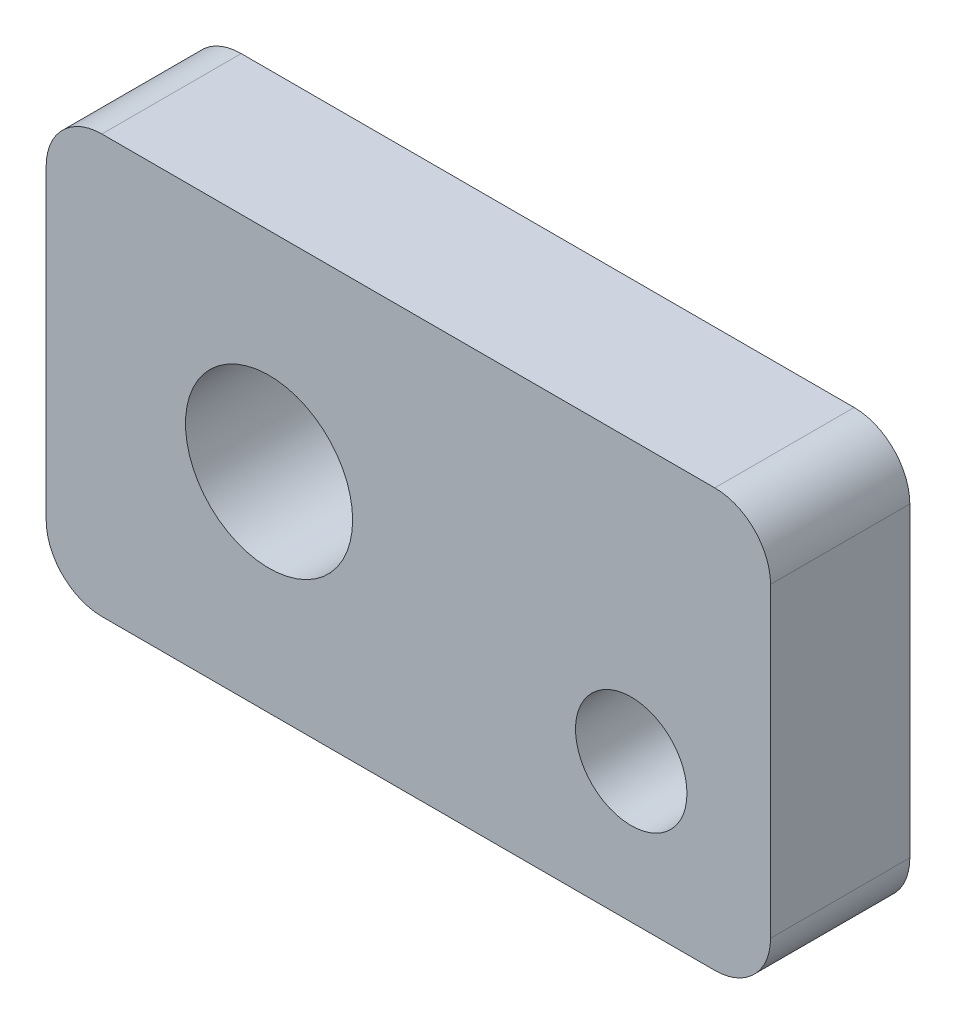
ISO-10303-21;
HEADER;
FILE_DESCRIPTION(('STEP AP214'),'2;1');
FILE_NAME('part.step','',(''),(''),'','','');
FILE_SCHEMA(('AUTOMOTIVE_DESIGN { 1 0 10303 214 1 1 1 1 }'));
ENDSEC;
DATA;
#1=APPLICATION_CONTEXT('core data for automotive mechanical design processes');
#2=APPLICATION_PROTOCOL_DEFINITION('international standard','automotive_design',2000,#1);
#3=PRODUCT_CONTEXT('',#1,'mechanical');
#4=PRODUCT('Part','Part','',(#3));
#5=PRODUCT_RELATED_PRODUCT_CATEGORY('part','',(#4));
#6=PRODUCT_DEFINITION_FORMATION('','',#4);
#7=PRODUCT_DEFINITION_CONTEXT('part definition',#1,'design');
#8=PRODUCT_DEFINITION('design','',#6,#7);
#9=PRODUCT_DEFINITION_SHAPE('','',#8);
#10=(LENGTH_UNIT() NAMED_UNIT(*) SI_UNIT(.MILLI.,.METRE.));
#11=(NAMED_UNIT(*) PLANE_ANGLE_UNIT() SI_UNIT($,.RADIAN.));
#12=(NAMED_UNIT(*) SI_UNIT($,.STERADIAN.) SOLID_ANGLE_UNIT());
#13=UNCERTAINTY_MEASURE_WITH_UNIT(LENGTH_MEASURE(1.E-05),#10,'distance_accuracy_value','');
#14=(GEOMETRIC_REPRESENTATION_CONTEXT(3) GLOBAL_UNCERTAINTY_ASSIGNED_CONTEXT((#13)) GLOBAL_UNIT_ASSIGNED_CONTEXT((#10,
#11,#12)) REPRESENTATION_CONTEXT('',''));
#15=CARTESIAN_POINT('',(0.,0.,0.));
#16=DIRECTION('',(0.,0.,1.));
#17=DIRECTION('',(1.,0.,0.));
#18=AXIS2_PLACEMENT_3D('',#15,#16,#17);
#19=CARTESIAN_POINT('',(0.,0.,5.));
#20=DIRECTION('',(0.,0.,1.));
#21=DIRECTION('',(1.,0.,0.));
#22=AXIS2_PLACEMENT_3D('',#19,#20,#21);
#23=PLANE('',#22);
#24=CARTESIAN_POINT('',(-5.,0.,5.));
#25=DIRECTION('',(0.,0.,1.));
#26=DIRECTION('',(1.,0.,0.));
#27=AXIS2_PLACEMENT_3D('',#24,#25,#26);
#28=CIRCLE('',#27,3.);
#29=CARTESIAN_POINT('',(-2.,0.,5.));
#30=VERTEX_POINT('',#29);
#31=EDGE_CURVE('E165',#30,#30,#28,.T.);
#32=ORIENTED_EDGE('',*,*,#31,.F.);
#33=EDGE_LOOP('',(#32));
#34=FACE_BOUND('',#33,.T.);
#35=DIRECTION('',(0.,-1.,0.));
#36=VECTOR('',#35,1.);
#37=CARTESIAN_POINT('',(-13.,7.50000000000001,5.));
#38=LINE('',#37,#36);
#39=CARTESIAN_POINT('',(-13.,5.50000000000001,5.));
#40=VERTEX_POINT('',#39);
#41=CARTESIAN_POINT('',(-13.,-5.49999999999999,5.));
#42=VERTEX_POINT('',#41);
#43=EDGE_CURVE('E172',#40,#42,#38,.T.);
#44=ORIENTED_EDGE('',*,*,#43,.T.);
#45=CARTESIAN_POINT('',(-11.,-5.49999999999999,5.));
#46=DIRECTION('',(0.,0.,1.));
#47=DIRECTION('',(1.,0.,0.));
#48=AXIS2_PLACEMENT_3D('',#45,#46,#47);
#49=CIRCLE('',#48,2.);
#50=CARTESIAN_POINT('',(-11.,-7.49999999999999,5.));
#51=VERTEX_POINT('',#50);
#52=EDGE_CURVE('E149',#42,#51,#49,.T.);
#53=ORIENTED_EDGE('',*,*,#52,.T.);
#54=DIRECTION('',(1.,0.,0.));
#55=VECTOR('',#54,1.);
#56=CARTESIAN_POINT('',(-13.,-7.49999999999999,5.));
#57=LINE('',#56,#55);
#58=CARTESIAN_POINT('',(11.,-7.49999999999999,5.));
#59=VERTEX_POINT('',#58);
#60=EDGE_CURVE('E120',#51,#59,#57,.T.);
#61=ORIENTED_EDGE('',*,*,#60,.T.);
#62=CARTESIAN_POINT('',(11.,-5.49999999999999,5.));
#63=DIRECTION('',(0.,0.,1.));
#64=DIRECTION('',(1.,0.,0.));
#65=AXIS2_PLACEMENT_3D('',#62,#63,#64);
#66=CIRCLE('',#65,2.);
#67=CARTESIAN_POINT('',(13.,-5.49999999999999,5.));
#68=VERTEX_POINT('',#67);
#69=EDGE_CURVE('E147',#59,#68,#66,.T.);
#70=ORIENTED_EDGE('',*,*,#69,.T.);
#71=DIRECTION('',(0.,1.,0.));
#72=VECTOR('',#71,1.);
#73=CARTESIAN_POINT('',(13.,7.50000000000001,5.));
#74=LINE('',#73,#72);
#75=CARTESIAN_POINT('',(13.,5.50000000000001,5.));
#76=VERTEX_POINT('',#75);
#77=EDGE_CURVE('E127',#68,#76,#74,.T.);
#78=ORIENTED_EDGE('',*,*,#77,.T.);
#79=CARTESIAN_POINT('',(11.,5.50000000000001,5.));
#80=DIRECTION('',(0.,0.,1.));
#81=DIRECTION('',(1.,0.,0.));
#82=AXIS2_PLACEMENT_3D('',#79,#80,#81);
#83=CIRCLE('',#82,2.);
#84=CARTESIAN_POINT('',(11.,7.50000000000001,5.));
#85=VERTEX_POINT('',#84);
#86=EDGE_CURVE('E55',#76,#85,#83,.T.);
#87=ORIENTED_EDGE('',*,*,#86,.T.);
#88=DIRECTION('',(-1.,0.,0.));
#89=VECTOR('',#88,1.);
#90=CARTESIAN_POINT('',(-13.,7.50000000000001,5.));
#91=LINE('',#90,#89);
#92=CARTESIAN_POINT('',(-11.,7.50000000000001,5.));
#93=VERTEX_POINT('',#92);
#94=EDGE_CURVE('E130',#85,#93,#91,.T.);
#95=ORIENTED_EDGE('',*,*,#94,.T.);
#96=CARTESIAN_POINT('',(-11.,5.50000000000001,5.));
#97=DIRECTION('',(0.,0.,1.));
#98=DIRECTION('',(1.,0.,0.));
#99=AXIS2_PLACEMENT_3D('',#96,#97,#98);
#100=CIRCLE('',#99,2.);
#101=EDGE_CURVE('E144',#93,#40,#100,.T.);
#102=ORIENTED_EDGE('',*,*,#101,.T.);
#103=EDGE_LOOP('',(#44,#53,#61,#70,#78,#87,#95,#102));
#104=FACE_BOUND('',#103,.T.);
#105=CARTESIAN_POINT('',(8.,-2.49999999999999,5.));
#106=DIRECTION('',(0.,0.,1.));
#107=DIRECTION('',(1.,0.,0.));
#108=AXIS2_PLACEMENT_3D('',#105,#106,#107);
#109=CIRCLE('',#108,2.);
#110=CARTESIAN_POINT('',(10.,-2.49999999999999,5.));
#111=VERTEX_POINT('',#110);
#112=EDGE_CURVE('E177',#111,#111,#109,.T.);
#113=ORIENTED_EDGE('',*,*,#112,.F.);
#114=EDGE_LOOP('',(#113));
#115=FACE_BOUND('',#114,.T.);
#116=ADVANCED_FACE('F34',(#34,#104,#115),#23,.T.);
#117=CARTESIAN_POINT('',(0.,0.,0.));
#118=DIRECTION('',(0.,0.,1.));
#119=DIRECTION('',(1.,0.,0.));
#120=AXIS2_PLACEMENT_3D('',#117,#118,#119);
#121=PLANE('',#120);
#122=DIRECTION('',(1.,0.,0.));
#123=VECTOR('',#122,1.);
#124=CARTESIAN_POINT('',(-13.,-7.49999999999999,0.));
#125=LINE('',#124,#123);
#126=CARTESIAN_POINT('',(-11.,-7.49999999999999,0.));
#127=VERTEX_POINT('',#126);
#128=CARTESIAN_POINT('',(11.,-7.49999999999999,0.));
#129=VERTEX_POINT('',#128);
#130=EDGE_CURVE('E117',#127,#129,#125,.T.);
#131=ORIENTED_EDGE('',*,*,#130,.F.);
#132=CARTESIAN_POINT('',(-11.,-5.49999999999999,0.));
#133=DIRECTION('',(0.,0.,1.));
#134=DIRECTION('',(1.,0.,0.));
#135=AXIS2_PLACEMENT_3D('',#132,#133,#134);
#136=CIRCLE('',#135,2.);
#137=CARTESIAN_POINT('',(-13.,-5.49999999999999,0.));
#138=VERTEX_POINT('',#137);
#139=EDGE_CURVE('E100',#127,#138,#136,.F.);
#140=ORIENTED_EDGE('',*,*,#139,.T.);
#141=DIRECTION('',(0.,-1.,0.));
#142=VECTOR('',#141,1.);
#143=CARTESIAN_POINT('',(-13.,7.50000000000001,0.));
#144=LINE('',#143,#142);
#145=CARTESIAN_POINT('',(-13.,5.50000000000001,0.));
#146=VERTEX_POINT('',#145);
#147=EDGE_CURVE('E128',#146,#138,#144,.T.);
#148=ORIENTED_EDGE('',*,*,#147,.F.);
#149=CARTESIAN_POINT('',(-11.,5.50000000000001,0.));
#150=DIRECTION('',(0.,0.,1.));
#151=DIRECTION('',(1.,0.,0.));
#152=AXIS2_PLACEMENT_3D('',#149,#150,#151);
#153=CIRCLE('',#152,2.);
#154=CARTESIAN_POINT('',(-11.,7.50000000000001,0.));
#155=VERTEX_POINT('',#154);
#156=EDGE_CURVE('E121',#146,#155,#153,.F.);
#157=ORIENTED_EDGE('',*,*,#156,.T.);
#158=DIRECTION('',(-1.,0.,0.));
#159=VECTOR('',#158,1.);
#160=CARTESIAN_POINT('',(-13.,7.50000000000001,0.));
#161=LINE('',#160,#159);
#162=CARTESIAN_POINT('',(11.,7.50000000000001,0.));
#163=VERTEX_POINT('',#162);
#164=EDGE_CURVE('E132',#163,#155,#161,.T.);
#165=ORIENTED_EDGE('',*,*,#164,.F.);
#166=CARTESIAN_POINT('',(11.,5.50000000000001,0.));
#167=DIRECTION('',(0.,0.,1.));
#168=DIRECTION('',(1.,0.,0.));
#169=AXIS2_PLACEMENT_3D('',#166,#167,#168);
#170=CIRCLE('',#169,2.);
#171=CARTESIAN_POINT('',(13.,5.50000000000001,0.));
#172=VERTEX_POINT('',#171);
#173=EDGE_CURVE('E138',#163,#172,#170,.F.);
#174=ORIENTED_EDGE('',*,*,#173,.T.);
#175=DIRECTION('',(0.,1.,0.));
#176=VECTOR('',#175,1.);
#177=CARTESIAN_POINT('',(13.,7.50000000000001,0.));
#178=LINE('',#177,#176);
#179=CARTESIAN_POINT('',(13.,-5.49999999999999,0.));
#180=VERTEX_POINT('',#179);
#181=EDGE_CURVE('E160',#180,#172,#178,.T.);
#182=ORIENTED_EDGE('',*,*,#181,.F.);
#183=CARTESIAN_POINT('',(11.,-5.49999999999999,0.));
#184=DIRECTION('',(0.,0.,1.));
#185=DIRECTION('',(1.,0.,0.));
#186=AXIS2_PLACEMENT_3D('',#183,#184,#185);
#187=CIRCLE('',#186,2.);
#188=EDGE_CURVE('E111',#180,#129,#187,.F.);
#189=ORIENTED_EDGE('',*,*,#188,.T.);
#190=EDGE_LOOP('',(#131,#140,#148,#157,#165,#174,#182,#189));
#191=FACE_BOUND('',#190,.T.);
#192=CARTESIAN_POINT('',(-5.,0.,0.));
#193=DIRECTION('',(0.,0.,1.));
#194=DIRECTION('',(1.,0.,0.));
#195=AXIS2_PLACEMENT_3D('',#192,#193,#194);
#196=CIRCLE('',#195,3.);
#197=CARTESIAN_POINT('',(-2.,0.,0.));
#198=VERTEX_POINT('',#197);
#199=EDGE_CURVE('E168',#198,#198,#196,.T.);
#200=ORIENTED_EDGE('',*,*,#199,.T.);
#201=EDGE_LOOP('',(#200));
#202=FACE_BOUND('',#201,.T.);
#203=CARTESIAN_POINT('',(8.,-2.49999999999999,0.));
#204=DIRECTION('',(0.,0.,1.));
#205=DIRECTION('',(1.,0.,0.));
#206=AXIS2_PLACEMENT_3D('',#203,#204,#205);
#207=CIRCLE('',#206,2.);
#208=CARTESIAN_POINT('',(10.,-2.49999999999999,0.));
#209=VERTEX_POINT('',#208);
#210=EDGE_CURVE('E179',#209,#209,#207,.T.);
#211=ORIENTED_EDGE('',*,*,#210,.T.);
#212=EDGE_LOOP('',(#211));
#213=FACE_BOUND('',#212,.T.);
#214=ADVANCED_FACE('F124',(#191,#202,#213),#121,.F.);
#215=CARTESIAN_POINT('',(13.,7.50000000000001,5.));
#216=DIRECTION('',(-1.,0.,0.));
#217=DIRECTION('',(0.,-1.,0.));
#218=AXIS2_PLACEMENT_3D('',#215,#216,#217);
#219=PLANE('',#218);
#220=ORIENTED_EDGE('',*,*,#77,.F.);
#221=DIRECTION('',(0.,0.,-1.));
#222=VECTOR('',#221,1.);
#223=CARTESIAN_POINT('',(13.,-5.49999999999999,5.));
#224=LINE('',#223,#222);
#225=EDGE_CURVE('E153',#68,#180,#224,.T.);
#226=ORIENTED_EDGE('',*,*,#225,.T.);
#227=ORIENTED_EDGE('',*,*,#181,.T.);
#228=DIRECTION('',(0.,0.,-1.));
#229=VECTOR('',#228,1.);
#230=CARTESIAN_POINT('',(13.,5.50000000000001,5.));
#231=LINE('',#230,#229);
#232=EDGE_CURVE('E151',#172,#76,#231,.F.);
#233=ORIENTED_EDGE('',*,*,#232,.T.);
#234=EDGE_LOOP('',(#220,#226,#227,#233));
#235=FACE_BOUND('',#234,.T.);
#236=ADVANCED_FACE('F159',(#235),#219,.F.);
#237=CARTESIAN_POINT('',(-13.,7.50000000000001,5.));
#238=DIRECTION('',(0.,-1.,0.));
#239=DIRECTION('',(1.,0.,0.));
#240=AXIS2_PLACEMENT_3D('',#237,#238,#239);
#241=PLANE('',#240);
#242=ORIENTED_EDGE('',*,*,#94,.F.);
#243=DIRECTION('',(0.,0.,-1.));
#244=VECTOR('',#243,1.);
#245=CARTESIAN_POINT('',(11.,7.50000000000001,5.));
#246=LINE('',#245,#244);
#247=EDGE_CURVE('E11',#85,#163,#246,.T.);
#248=ORIENTED_EDGE('',*,*,#247,.T.);
#249=ORIENTED_EDGE('',*,*,#164,.T.);
#250=DIRECTION('',(0.,0.,-1.));
#251=VECTOR('',#250,1.);
#252=CARTESIAN_POINT('',(-11.,7.50000000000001,5.));
#253=LINE('',#252,#251);
#254=EDGE_CURVE('E42',#155,#93,#253,.F.);
#255=ORIENTED_EDGE('',*,*,#254,.T.);
#256=EDGE_LOOP('',(#242,#248,#249,#255));
#257=FACE_BOUND('',#256,.T.);
#258=ADVANCED_FACE('F205',(#257),#241,.F.);
#259=CARTESIAN_POINT('',(-13.,7.50000000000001,5.));
#260=DIRECTION('',(1.,0.,0.));
#261=DIRECTION('',(0.,1.,0.));
#262=AXIS2_PLACEMENT_3D('',#259,#260,#261);
#263=PLANE('',#262);
#264=ORIENTED_EDGE('',*,*,#147,.T.);
#265=DIRECTION('',(0.,0.,-1.));
#266=VECTOR('',#265,1.);
#267=CARTESIAN_POINT('',(-13.,-5.49999999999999,5.));
#268=LINE('',#267,#266);
#269=EDGE_CURVE('E105',#138,#42,#268,.F.);
#270=ORIENTED_EDGE('',*,*,#269,.T.);
#271=ORIENTED_EDGE('',*,*,#43,.F.);
#272=DIRECTION('',(0.,0.,-1.));
#273=VECTOR('',#272,1.);
#274=CARTESIAN_POINT('',(-13.,5.50000000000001,5.));
#275=LINE('',#274,#273);
#276=EDGE_CURVE('E110',#40,#146,#275,.T.);
#277=ORIENTED_EDGE('',*,*,#276,.T.);
#278=EDGE_LOOP('',(#264,#270,#271,#277));
#279=FACE_BOUND('',#278,.T.);
#280=ADVANCED_FACE('F202',(#279),#263,.F.);
#281=CARTESIAN_POINT('',(-13.,-7.49999999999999,5.));
#282=DIRECTION('',(0.,1.,0.));
#283=DIRECTION('',(0.,0.,1.));
#284=AXIS2_PLACEMENT_3D('',#281,#282,#283);
#285=PLANE('',#284);
#286=ORIENTED_EDGE('',*,*,#60,.F.);
#287=DIRECTION('',(0.,0.,-1.));
#288=VECTOR('',#287,1.);
#289=CARTESIAN_POINT('',(-11.,-7.49999999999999,5.));
#290=LINE('',#289,#288);
#291=EDGE_CURVE('E104',#51,#127,#290,.T.);
#292=ORIENTED_EDGE('',*,*,#291,.T.);
#293=ORIENTED_EDGE('',*,*,#130,.T.);
#294=DIRECTION('',(0.,0.,-1.));
#295=VECTOR('',#294,1.);
#296=CARTESIAN_POINT('',(11.,-7.49999999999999,5.));
#297=LINE('',#296,#295);
#298=EDGE_CURVE('E122',#129,#59,#297,.F.);
#299=ORIENTED_EDGE('',*,*,#298,.T.);
#300=EDGE_LOOP('',(#286,#292,#293,#299));
#301=FACE_BOUND('',#300,.T.);
#302=ADVANCED_FACE('F116',(#301),#285,.F.);
#303=CARTESIAN_POINT('',(-5.,0.,5.));
#304=DIRECTION('',(0.,0.,-1.));
#305=DIRECTION('',(-1.,0.,0.));
#306=AXIS2_PLACEMENT_3D('',#303,#304,#305);
#307=CYLINDRICAL_SURFACE('',#306,3.);
#308=ORIENTED_EDGE('',*,*,#31,.T.);
#309=EDGE_LOOP('',(#308));
#310=FACE_BOUND('',#309,.T.);
#311=ORIENTED_EDGE('',*,*,#199,.F.);
#312=EDGE_LOOP('',(#311));
#313=FACE_BOUND('',#312,.T.);
#314=ADVANCED_FACE('F197',(#310,#313),#307,.F.);
#315=CARTESIAN_POINT('',(8.,-2.49999999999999,5.));
#316=DIRECTION('',(0.,0.,-1.));
#317=DIRECTION('',(-1.,0.,0.));
#318=AXIS2_PLACEMENT_3D('',#315,#316,#317);
#319=CYLINDRICAL_SURFACE('',#318,2.);
#320=ORIENTED_EDGE('',*,*,#112,.T.);
#321=EDGE_LOOP('',(#320));
#322=FACE_BOUND('',#321,.T.);
#323=ORIENTED_EDGE('',*,*,#210,.F.);
#324=EDGE_LOOP('',(#323));
#325=FACE_BOUND('',#324,.T.);
#326=ADVANCED_FACE('F185',(#322,#325),#319,.F.);
#327=CARTESIAN_POINT('',(-11.,-5.49999999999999,5.));
#328=DIRECTION('',(0.,0.,-1.));
#329=DIRECTION('',(-1.,0.,0.));
#330=AXIS2_PLACEMENT_3D('',#327,#328,#329);
#331=CYLINDRICAL_SURFACE('',#330,2.);
#332=ORIENTED_EDGE('',*,*,#52,.F.);
#333=ORIENTED_EDGE('',*,*,#269,.F.);
#334=ORIENTED_EDGE('',*,*,#139,.F.);
#335=ORIENTED_EDGE('',*,*,#291,.F.);
#336=EDGE_LOOP('',(#332,#333,#334,#335));
#337=FACE_BOUND('',#336,.T.);
#338=ADVANCED_FACE('F103',(#337),#331,.T.);
#339=CARTESIAN_POINT('',(11.,-5.49999999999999,5.));
#340=DIRECTION('',(0.,0.,-1.));
#341=DIRECTION('',(-1.,0.,0.));
#342=AXIS2_PLACEMENT_3D('',#339,#340,#341);
#343=CYLINDRICAL_SURFACE('',#342,2.);
#344=ORIENTED_EDGE('',*,*,#69,.F.);
#345=ORIENTED_EDGE('',*,*,#298,.F.);
#346=ORIENTED_EDGE('',*,*,#188,.F.);
#347=ORIENTED_EDGE('',*,*,#225,.F.);
#348=EDGE_LOOP('',(#344,#345,#346,#347));
#349=FACE_BOUND('',#348,.T.);
#350=ADVANCED_FACE('F213',(#349),#343,.T.);
#351=CARTESIAN_POINT('',(11.,5.50000000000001,5.));
#352=DIRECTION('',(0.,0.,-1.));
#353=DIRECTION('',(-1.,0.,0.));
#354=AXIS2_PLACEMENT_3D('',#351,#352,#353);
#355=CYLINDRICAL_SURFACE('',#354,2.);
#356=ORIENTED_EDGE('',*,*,#86,.F.);
#357=ORIENTED_EDGE('',*,*,#232,.F.);
#358=ORIENTED_EDGE('',*,*,#173,.F.);
#359=ORIENTED_EDGE('',*,*,#247,.F.);
#360=EDGE_LOOP('',(#356,#357,#358,#359));
#361=FACE_BOUND('',#360,.T.);
#362=ADVANCED_FACE('F215',(#361),#355,.T.);
#363=CARTESIAN_POINT('',(-11.,5.50000000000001,5.));
#364=DIRECTION('',(0.,0.,-1.));
#365=DIRECTION('',(-1.,0.,0.));
#366=AXIS2_PLACEMENT_3D('',#363,#364,#365);
#367=CYLINDRICAL_SURFACE('',#366,2.);
#368=ORIENTED_EDGE('',*,*,#101,.F.);
#369=ORIENTED_EDGE('',*,*,#254,.F.);
#370=ORIENTED_EDGE('',*,*,#156,.F.);
#371=ORIENTED_EDGE('',*,*,#276,.F.);
#372=EDGE_LOOP('',(#368,#369,#370,#371));
#373=FACE_BOUND('',#372,.T.);
#374=ADVANCED_FACE('F36',(#373),#367,.T.);
#375=CLOSED_SHELL('',(#116,#214,#236,#258,#280,#302,#314,#326,#338,#350,#362,#374));
#376=MANIFOLD_SOLID_BREP('B2',#375);
#377=ADVANCED_BREP_SHAPE_REPRESENTATION('',(#18,#376),#14);
#378=SHAPE_DEFINITION_REPRESENTATION(#9,#377);
ENDSEC;
END-ISO-10303-21;
